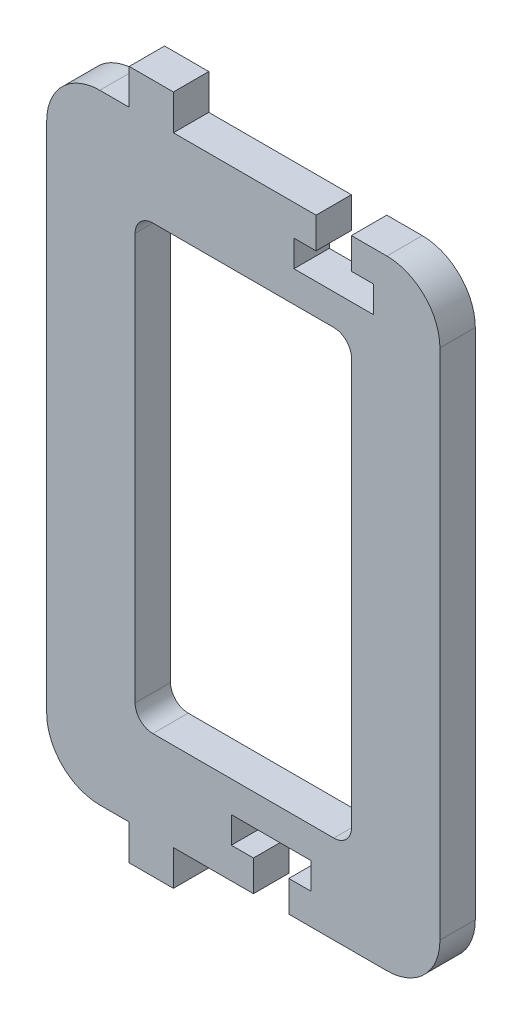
from build123d import *

# Parameters (mm, degrees)
SALIENTE_EXTRUIR1_DEPTH = 4


with BuildPart() as part:
    # Croquis1 → Saliente-Extruir1 (new body)
    with BuildSketch(Plane.XY):
        with BuildLine():
            Line((-48.365211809, -20.854133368), (-51.695211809, -20.854133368))
            ThreePointArc((-51.695211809, -20.854133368), (-55.937852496, -19.096774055), (-57.695211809, -14.854133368))
            Line((-57.695211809, -14.854133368), (-57.695211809, 43.145866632))
            ThreePointArc((-57.695211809, 43.145866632), (-55.937852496, 47.388507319), (-51.695211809, 49.145866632))
            Line((-51.695211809, 49.145866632), (-48.365211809, 49.145866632))
            Line((-48.365211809, 49.145866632), (-48.365211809, 53.145866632))
            Line((-48.365211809, 53.145866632), (-43.365211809, 53.145866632))
            Line((-43.365211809, 53.145866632), (-43.365211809, 49.145866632))
            Line((-43.365211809, 49.145866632), (-27.235211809, 49.145866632))
            Line((-27.235211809, 49.145866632), (-27.235211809, 45.645866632))
            Line((-27.235211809, 45.645866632), (-29.735211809, 45.645866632))
            Line((-29.735211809, 45.645866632), (-29.735211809, 42.645866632))
            Line((-29.735211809, 42.645866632), (-20.735211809, 42.645866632))
            Line((-20.735211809, 42.645866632), (-20.735211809, 45.645866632))
            Line((-20.735211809, 45.645866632), (-23.235211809, 45.645866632))
            Line((-23.235211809, 45.645866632), (-23.235211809, 49.145866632))
            Line((-23.235211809, 49.145866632), (-19.225211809, 49.145866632))
            ThreePointArc((-19.225211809, 49.145866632), (-14.982571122, 47.388507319), (-13.225211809, 43.145866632))
            Line((-13.225211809, 43.145866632), (-13.225211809, -14.854133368))
            ThreePointArc((-13.225211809, -14.854133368), (-14.982571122, -19.096774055), (-19.225211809, -20.854133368))
            Line((-19.225211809, -20.854133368), (-30.315211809, -20.854133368))
            Line((-30.315211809, -20.854133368), (-30.315211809, -17.354133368))
            Line((-30.315211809, -17.354133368), (-27.815211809, -17.354133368))
            Line((-27.815211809, -17.354133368), (-27.815211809, -14.354133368))
            Line((-27.815211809, -14.354133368), (-36.815211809, -14.354133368))
            Line((-36.815211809, -14.354133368), (-36.815211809, -17.354133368))
            Line((-36.815211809, -17.354133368), (-34.315211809, -17.354133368))
            Line((-34.315211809, -17.354133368), (-34.315211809, -20.854133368))
            Line((-34.315211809, -20.854133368), (-43.365211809, -20.854133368))
            Line((-43.365211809, -20.854133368), (-43.365211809, -24.854133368))
            Line((-43.365211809, -24.854133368), (-48.365211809, -24.854133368))
            Line((-48.365211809, -24.854133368), (-48.365211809, -20.854133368))
        make_face()
        with BuildLine():
            Line((-47.695211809, 14.145866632), (-47.695211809, -8.854133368))
            ThreePointArc((-47.695211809, -8.854133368), (-47.109425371, -10.26834693), (-45.695211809, -10.854133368))
            Line((-45.695211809, -10.854133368), (-25.225211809, -10.854133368))
            ThreePointArc((-25.225211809, -10.854133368), (-23.810998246, -10.26834693), (-23.225211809, -8.854133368))
            Line((-23.225211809, -8.854133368), (-23.225211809, 37.145866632))
            ThreePointArc((-23.225211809, 37.145866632), (-23.810998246, 38.560080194), (-25.225211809, 39.145866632))
            Line((-25.225211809, 39.145866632), (-45.695211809, 39.145866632))
            ThreePointArc((-45.695211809, 39.145866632), (-47.109425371, 38.560080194), (-47.695211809, 37.145866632))
            Line((-47.695211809, 37.145866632), (-47.695211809, 14.145866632))
        make_face(mode=Mode.SUBTRACT)
    extrude(amount=SALIENTE_EXTRUIR1_DEPTH)


solid = part.part
